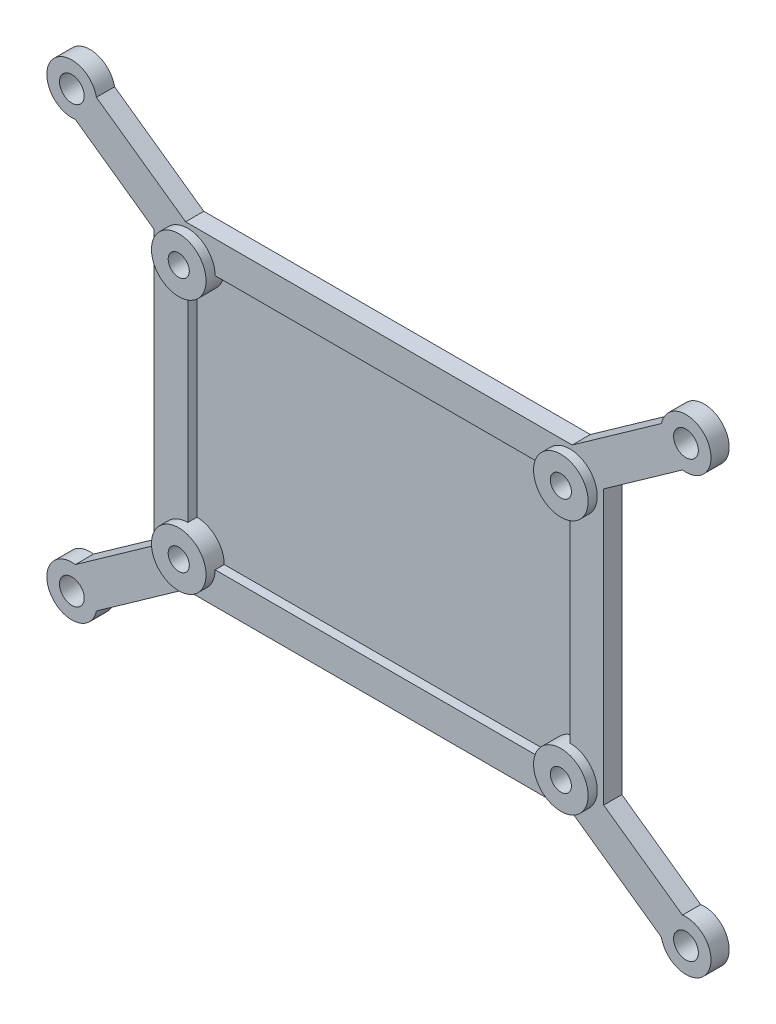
from build123d import *

# Parameters (mm, degrees)
BOSS_EXTRUDE1_DEPTH       = 2.54
F_4_CLEARANCE_HOLE1_D     = 3.4544
F_4_CLEARANCE_HOLE1_DEPTH = 6.35
F_4_CLEARANCE_HOLE1_TIP   = 1.037806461
SKETCH4_R                 = 3.81
BOSS_EXTRUDE2_DEPTH       = 1.27
F_4_CLEARANCE_HOLE2_D     = 2.9464
CUT_EXTRUDE1_START        = -1.27
CUT_EXTRUDE1_DEPTH        = 1.27


with BuildPart() as part:
    # Sketch1 → Boss-Extrude1 (new body)
    with BuildSketch(Plane.XY):
        with BuildLine():
            Line((39.438249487, 31.049569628), (26.98067466, 22.225))
            Line((26.98067466, 22.225), (-26.98067466, 22.225))
            Line((-26.98067466, 22.225), (-39.438249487, 31.049569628))
            ThreePointArc((-39.438249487, 31.049569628), (-45.712416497, 32.381294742), (-42.374678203, 26.904236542))
            Line((-42.374678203, 26.904236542), (-31.374855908, 19.112294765))
            Line((-31.374855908, 19.112294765), (-31.374855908, -19.112294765))
            Line((-31.374855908, -19.112294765), (-42.374678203, -26.904236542))
            ThreePointArc((-42.374678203, -26.904236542), (-45.712416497, -32.381294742), (-39.438249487, -31.049569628))
            Line((-39.438249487, -31.049569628), (-26.98067466, -22.225))
            Line((-26.98067466, -22.225), (26.98067466, -22.225))
            Line((26.98067466, -22.225), (39.438249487, -31.049569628))
            ThreePointArc((39.438249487, -31.049569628), (45.712416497, -32.381294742), (42.374678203, -26.904236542))
            Line((42.374678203, -26.904236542), (31.374855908, -19.112294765))
            Line((31.374855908, -19.112294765), (31.374855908, 19.112294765))
            Line((31.374855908, 19.112294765), (42.374678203, 26.904236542))
            ThreePointArc((42.374678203, 26.904236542), (45.712416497, 32.381294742), (39.438249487, 31.049569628))
        make_face()
    extrude(amount=BOSS_EXTRUDE1_DEPTH)

    # 4 Clearance Hole1
    with Locations(Plane.XY.offset(2.54)):
        with Locations((-42.8625, 30.3625), (42.8625, 30.3625), (-42.8625, -30.3625), (42.8625, -30.3625)):
            Hole(F_4_CLEARANCE_HOLE1_D / 2, depth=F_4_CLEARANCE_HOLE1_DEPTH)
            with Locations((0, 0, -(F_4_CLEARANCE_HOLE1_DEPTH + F_4_CLEARANCE_HOLE1_TIP / 2))):  # 118° drill point
                Cone(0, F_4_CLEARANCE_HOLE1_D / 2, F_4_CLEARANCE_HOLE1_TIP, mode=Mode.SUBTRACT)

    # Sketch4 → Boss-Extrude2 (add)
    with BuildSketch(Plane.XY.offset(2.54)):
        with Locations((-26.67, 17.78)):
            Circle(SKETCH4_R)
        with Locations((-26.67, -17.78)):
            Circle(SKETCH4_R)
        with Locations((26.67, -17.78)):
            Circle(SKETCH4_R)
        with Locations((26.67, 17.78)):
            Circle(SKETCH4_R)
    extrude(amount=BOSS_EXTRUDE2_DEPTH)

    # 4 Clearance Hole2 (through all)
    with Locations(Plane.XY.offset(3.81)):
        with Locations((-26.67, 17.78), (-26.67, -17.78), (26.67, 17.78), (26.67, -17.78)):
            Hole(F_4_CLEARANCE_HOLE2_D / 2)

    # Sketch8 → Cut-Extrude1 (cut)
    with BuildSketch(Plane.XY.offset(2.54).offset(CUT_EXTRUDE1_START)):
        with BuildLine():
            Line((22.86, -17.78), (-22.86, -17.78))
            ThreePointArc((-22.86, -17.78), (-23.975923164, -15.085923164), (-26.67, -13.97))
            Line((-26.67, -13.97), (-26.67, 13.97))
            ThreePointArc((-26.67, 13.97), (-23.975923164, 15.085923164), (-22.86, 17.78))
            Line((-22.86, 17.78), (22.86, 17.78))
            ThreePointArc((22.86, 17.78), (23.975923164, 15.085923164), (26.67, 13.97))
            Line((26.67, 13.97), (26.67, -13.97))
            ThreePointArc((26.67, -13.97), (23.975923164, -15.085923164), (22.86, -17.78))
        make_face()
    extrude(amount=CUT_EXTRUDE1_DEPTH, mode=Mode.SUBTRACT)


solid = part.part
